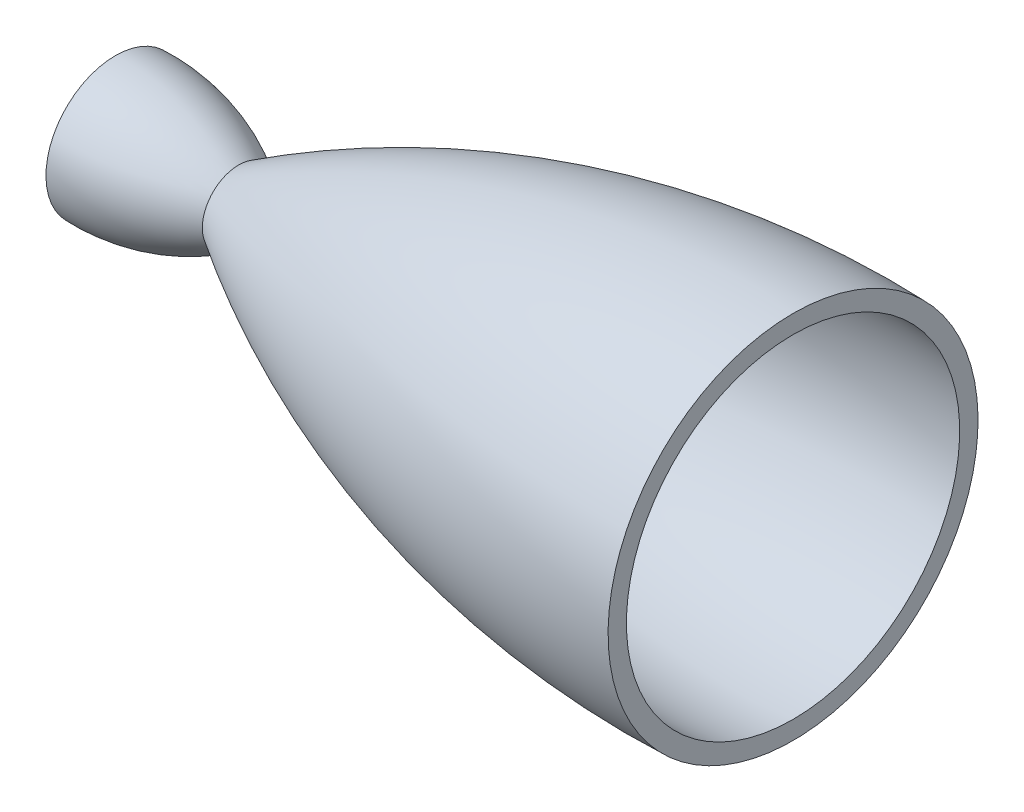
from build123d import *


with BuildPart() as part:
    # Sketch1 → Revolve2 (revolve)
    with BuildSketch(Plane.XY):
        with BuildLine():
            ThreePointArc((0, 10), (145.075869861, 72.781292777), (302.1, 91))
            Line((302.1, 91), (302.1, 81))
            ThreePointArc((302.1, 81), (145.016857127, 63.00138842), (0, 0))
            Line((0, 0), (0, 10))
        make_face()
        with BuildLine():
            ThreePointArc((-67.2, 28), (-32.258930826, 24.006658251), (0, 10))
            Line((0, 10), (0, 0))
            ThreePointArc((0, 0), (-32.196586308, 14.239411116), (-67.2, 18))
            Line((-67.2, 18), (-67.2, 28))
        make_face()
    revolve(axis=Axis((484.116684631, -9.8, 0), (-1, 0, 0)))


solid = part.part
